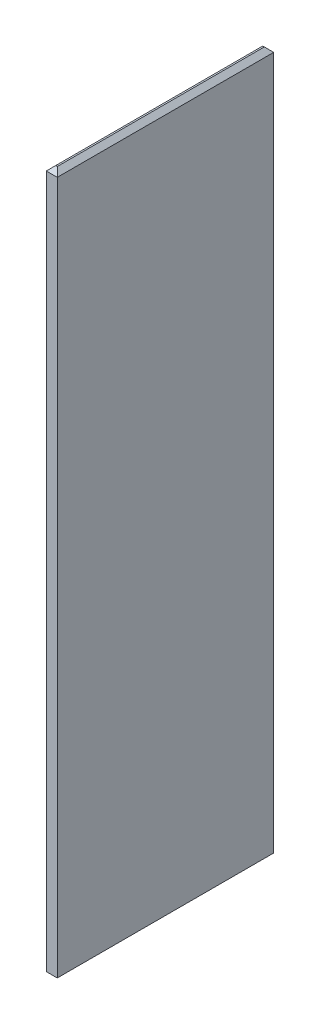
from build123d import *

# Parameters (mm, degrees)
SKETCH1_W           = 152.4
SKETCH1_H           = 3000
BOSS_EXTRUDE1_DEPTH = 9739.6
CHAMFER1_SIZE       = 65


with BuildPart() as part:
    # Sketch1 → Boss-Extrude1 (new body)
    with BuildSketch(Plane(origin=(0, 0, 0), x_dir=(-1, 0, 0), z_dir=(0, 1, 0))):
        Rectangle(SKETCH1_W, SKETCH1_H)
    extrude(amount=BOSS_EXTRUDE1_DEPTH)

    # Chamfer1
    chamfer1_edges = [part.edges().sort_by_distance(p)[0] for p in [
        (76.2, 9739.6, 0),
        (0, 9739.6, -1500),
        (-76.2, 9739.6, 0),
        (0, 0, -1500),
        (76.2, 0, 0),
        (0, 0, 1500),
        (-76.2, 0, 0),
        (0, 9739.6, 1500),
    ]]
    chamfer(chamfer1_edges, length=CHAMFER1_SIZE)


solid = part.part
